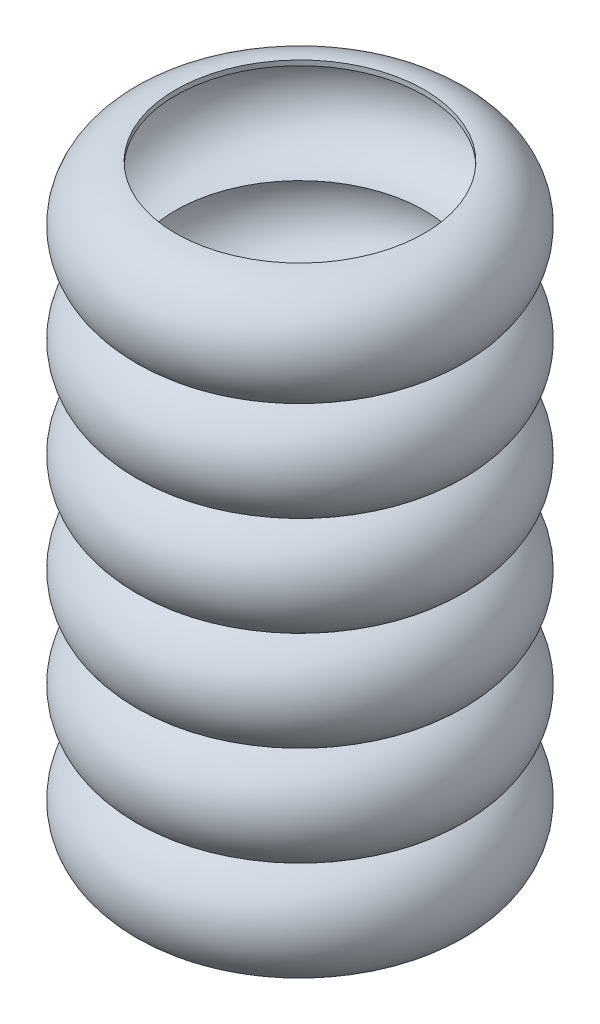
ISO-10303-21;
HEADER;
FILE_DESCRIPTION(('STEP AP214'),'2;1');
FILE_NAME('part.step','',(''),(''),'','','');
FILE_SCHEMA(('AUTOMOTIVE_DESIGN { 1 0 10303 214 1 1 1 1 }'));
ENDSEC;
DATA;
#1=APPLICATION_CONTEXT('core data for automotive mechanical design processes');
#2=APPLICATION_PROTOCOL_DEFINITION('international standard','automotive_design',2000,#1);
#3=PRODUCT_CONTEXT('',#1,'mechanical');
#4=PRODUCT('Part','Part','',(#3));
#5=PRODUCT_RELATED_PRODUCT_CATEGORY('part','',(#4));
#6=PRODUCT_DEFINITION_FORMATION('','',#4);
#7=PRODUCT_DEFINITION_CONTEXT('part definition',#1,'design');
#8=PRODUCT_DEFINITION('design','',#6,#7);
#9=PRODUCT_DEFINITION_SHAPE('','',#8);
#10=(LENGTH_UNIT() NAMED_UNIT(*) SI_UNIT(.MILLI.,.METRE.));
#11=(NAMED_UNIT(*) PLANE_ANGLE_UNIT() SI_UNIT($,.RADIAN.));
#12=(NAMED_UNIT(*) SI_UNIT($,.STERADIAN.) SOLID_ANGLE_UNIT());
#13=UNCERTAINTY_MEASURE_WITH_UNIT(LENGTH_MEASURE(1.E-05),#10,'distance_accuracy_value','');
#14=(GEOMETRIC_REPRESENTATION_CONTEXT(3) GLOBAL_UNCERTAINTY_ASSIGNED_CONTEXT((#13)) GLOBAL_UNIT_ASSIGNED_CONTEXT((#10,
#11,#12)) REPRESENTATION_CONTEXT('',''));
#15=CARTESIAN_POINT('',(0.,0.,0.));
#16=DIRECTION('',(0.,0.,1.));
#17=DIRECTION('',(1.,0.,0.));
#18=AXIS2_PLACEMENT_3D('',#15,#16,#17);
#19=CARTESIAN_POINT('',(0.,120.,0.));
#20=DIRECTION('',(0.,1.,0.));
#21=DIRECTION('',(0.,0.,1.));
#22=AXIS2_PLACEMENT_3D('',#19,#20,#21);
#23=CYLINDRICAL_SURFACE('',#22,25.);
#24=CARTESIAN_POINT('',(0.,120.,0.));
#25=DIRECTION('',(0.,-1.,0.));
#26=DIRECTION('',(0.,0.,-1.));
#27=AXIS2_PLACEMENT_3D('',#24,#25,#26);
#28=CIRCLE('',#27,25.);
#29=CARTESIAN_POINT('',(0.,120.,-25.));
#30=VERTEX_POINT('',#29);
#31=EDGE_CURVE('E83',#30,#30,#28,.F.);
#32=ORIENTED_EDGE('',*,*,#31,.F.);
#33=EDGE_LOOP('',(#32));
#34=FACE_BOUND('',#33,.T.);
#35=CARTESIAN_POINT('',(0.,121.,0.));
#36=DIRECTION('',(0.,-1.,0.));
#37=DIRECTION('',(0.,0.,-1.));
#38=AXIS2_PLACEMENT_3D('',#35,#36,#37);
#39=CIRCLE('',#38,25.);
#40=CARTESIAN_POINT('',(0.,121.,-25.));
#41=VERTEX_POINT('',#40);
#42=EDGE_CURVE('E10',#41,#41,#39,.F.);
#43=ORIENTED_EDGE('',*,*,#42,.T.);
#44=EDGE_LOOP('',(#43));
#45=FACE_BOUND('',#44,.T.);
#46=ADVANCED_FACE('F37',(#34,#45),#23,.F.);
#47=CARTESIAN_POINT('',(0.,30.,0.));
#48=DIRECTION('',(0.,-1.,0.));
#49=DIRECTION('',(0.,0.,-1.));
#50=AXIS2_PLACEMENT_3D('',#47,#48,#49);
#51=TOROIDAL_SURFACE('',#50,25.,11.);
#52=CARTESIAN_POINT('',(0.,40.,0.));
#53=DIRECTION('',(0.,1.,0.));
#54=DIRECTION('',(0.,0.,1.));
#55=AXIS2_PLACEMENT_3D('',#52,#53,#54);
#56=CIRCLE('',#55,29.5825756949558);
#57=CARTESIAN_POINT('',(0.,40.,29.5825756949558));
#58=VERTEX_POINT('',#57);
#59=EDGE_CURVE('E53',#58,#58,#56,.T.);
#60=ORIENTED_EDGE('',*,*,#59,.F.);
#61=EDGE_LOOP('',(#60));
#62=FACE_BOUND('',#61,.T.);
#63=CARTESIAN_POINT('',(0.,20.,0.));
#64=DIRECTION('',(0.,1.,0.));
#65=DIRECTION('',(0.,0.,1.));
#66=AXIS2_PLACEMENT_3D('',#63,#64,#65);
#67=CIRCLE('',#66,29.5825756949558);
#68=CARTESIAN_POINT('',(0.,20.,29.5825756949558));
#69=VERTEX_POINT('',#68);
#70=EDGE_CURVE('E48',#69,#69,#67,.T.);
#71=ORIENTED_EDGE('',*,*,#70,.T.);
#72=EDGE_LOOP('',(#71));
#73=FACE_BOUND('',#72,.T.);
#74=ADVANCED_FACE('F89',(#62,#73),#51,.T.);
#75=CARTESIAN_POINT('',(0.,-1.,0.));
#76=DIRECTION('',(0.,1.,0.));
#77=DIRECTION('',(0.,0.,1.));
#78=AXIS2_PLACEMENT_3D('',#75,#76,#77);
#79=PLANE('',#78);
#80=CARTESIAN_POINT('',(0.,-0.999999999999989,0.));
#81=DIRECTION('',(0.,-1.,0.));
#82=DIRECTION('',(0.,0.,-1.));
#83=AXIS2_PLACEMENT_3D('',#80,#81,#82);
#84=CIRCLE('',#83,25.);
#85=CARTESIAN_POINT('',(0.,-0.999999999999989,-25.));
#86=VERTEX_POINT('',#85);
#87=EDGE_CURVE('E44',#86,#86,#84,.F.);
#88=ORIENTED_EDGE('',*,*,#87,.F.);
#89=EDGE_LOOP('',(#88));
#90=FACE_BOUND('',#89,.T.);
#91=ADVANCED_FACE('F92',(#90),#79,.F.);
#92=CARTESIAN_POINT('',(0.,10.,0.));
#93=DIRECTION('',(0.,-1.,0.));
#94=DIRECTION('',(0.,0.,-1.));
#95=AXIS2_PLACEMENT_3D('',#92,#93,#94);
#96=TOROIDAL_SURFACE('',#95,25.,11.);
#97=ORIENTED_EDGE('',*,*,#70,.F.);
#98=EDGE_LOOP('',(#97));
#99=FACE_BOUND('',#98,.T.);
#100=ORIENTED_EDGE('',*,*,#87,.T.);
#101=EDGE_LOOP('',(#100));
#102=FACE_BOUND('',#101,.T.);
#103=ADVANCED_FACE('F96',(#99,#102),#96,.T.);
#104=CARTESIAN_POINT('',(0.,50.,0.));
#105=DIRECTION('',(0.,-1.,0.));
#106=DIRECTION('',(0.,0.,-1.));
#107=AXIS2_PLACEMENT_3D('',#104,#105,#106);
#108=TOROIDAL_SURFACE('',#107,25.,11.);
#109=CARTESIAN_POINT('',(0.,60.,0.));
#110=DIRECTION('',(0.,1.,0.));
#111=DIRECTION('',(0.,0.,1.));
#112=AXIS2_PLACEMENT_3D('',#109,#110,#111);
#113=CIRCLE('',#112,29.5825756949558);
#114=CARTESIAN_POINT('',(0.,60.,29.5825756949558));
#115=VERTEX_POINT('',#114);
#116=EDGE_CURVE('E57',#115,#115,#113,.T.);
#117=ORIENTED_EDGE('',*,*,#116,.F.);
#118=EDGE_LOOP('',(#117));
#119=FACE_BOUND('',#118,.T.);
#120=ORIENTED_EDGE('',*,*,#59,.T.);
#121=EDGE_LOOP('',(#120));
#122=FACE_BOUND('',#121,.T.);
#123=ADVANCED_FACE('F87',(#119,#122),#108,.T.);
#124=CARTESIAN_POINT('',(0.,70.,0.));
#125=DIRECTION('',(0.,-1.,0.));
#126=DIRECTION('',(0.,0.,-1.));
#127=AXIS2_PLACEMENT_3D('',#124,#125,#126);
#128=TOROIDAL_SURFACE('',#127,25.,11.);
#129=ORIENTED_EDGE('',*,*,#116,.T.);
#130=EDGE_LOOP('',(#129));
#131=FACE_BOUND('',#130,.T.);
#132=CARTESIAN_POINT('',(0.,80.,0.));
#133=DIRECTION('',(0.,1.,0.));
#134=DIRECTION('',(0.,0.,1.));
#135=AXIS2_PLACEMENT_3D('',#132,#133,#134);
#136=CIRCLE('',#135,29.5825756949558);
#137=CARTESIAN_POINT('',(0.,80.,29.5825756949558));
#138=VERTEX_POINT('',#137);
#139=EDGE_CURVE('E60',#138,#138,#136,.T.);
#140=ORIENTED_EDGE('',*,*,#139,.F.);
#141=EDGE_LOOP('',(#140));
#142=FACE_BOUND('',#141,.T.);
#143=ADVANCED_FACE('F103',(#131,#142),#128,.T.);
#144=CARTESIAN_POINT('',(0.,90.,0.));
#145=DIRECTION('',(0.,-1.,0.));
#146=DIRECTION('',(0.,0.,-1.));
#147=AXIS2_PLACEMENT_3D('',#144,#145,#146);
#148=TOROIDAL_SURFACE('',#147,25.,11.);
#149=ORIENTED_EDGE('',*,*,#139,.T.);
#150=EDGE_LOOP('',(#149));
#151=FACE_BOUND('',#150,.T.);
#152=CARTESIAN_POINT('',(0.,100.,0.));
#153=DIRECTION('',(0.,1.,0.));
#154=DIRECTION('',(0.,0.,1.));
#155=AXIS2_PLACEMENT_3D('',#152,#153,#154);
#156=CIRCLE('',#155,29.5825756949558);
#157=CARTESIAN_POINT('',(0.,100.,29.5825756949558));
#158=VERTEX_POINT('',#157);
#159=EDGE_CURVE('E62',#158,#158,#156,.T.);
#160=ORIENTED_EDGE('',*,*,#159,.F.);
#161=EDGE_LOOP('',(#160));
#162=FACE_BOUND('',#161,.T.);
#163=ADVANCED_FACE('F189',(#151,#162),#148,.T.);
#164=CARTESIAN_POINT('',(0.,110.,0.));
#165=DIRECTION('',(0.,-1.,0.));
#166=DIRECTION('',(0.,0.,-1.));
#167=AXIS2_PLACEMENT_3D('',#164,#165,#166);
#168=TOROIDAL_SURFACE('',#167,25.,11.);
#169=ORIENTED_EDGE('',*,*,#159,.T.);
#170=EDGE_LOOP('',(#169));
#171=FACE_BOUND('',#170,.T.);
#172=ORIENTED_EDGE('',*,*,#42,.F.);
#173=EDGE_LOOP('',(#172));
#174=FACE_BOUND('',#173,.T.);
#175=ADVANCED_FACE('F39',(#171,#174),#168,.T.);
#176=CARTESIAN_POINT('',(0.,30.,0.));
#177=DIRECTION('',(0.,-1.,0.));
#178=DIRECTION('',(0.,0.,-1.));
#179=AXIS2_PLACEMENT_3D('',#176,#177,#178);
#180=TOROIDAL_SURFACE('',#179,25.,9.99999999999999);
#181=CARTESIAN_POINT('',(0.,40.,0.));
#182=DIRECTION('',(0.,-1.,0.));
#183=DIRECTION('',(0.,0.,-1.));
#184=AXIS2_PLACEMENT_3D('',#181,#182,#183);
#185=CIRCLE('',#184,25.);
#186=CARTESIAN_POINT('',(0.,40.,-25.));
#187=VERTEX_POINT('',#186);
#188=EDGE_CURVE('E73',#187,#187,#185,.F.);
#189=ORIENTED_EDGE('',*,*,#188,.T.);
#190=EDGE_LOOP('',(#189));
#191=FACE_BOUND('',#190,.T.);
#192=CARTESIAN_POINT('',(0.,20.,0.));
#193=DIRECTION('',(0.,-1.,0.));
#194=DIRECTION('',(0.,0.,-1.));
#195=AXIS2_PLACEMENT_3D('',#192,#193,#194);
#196=CIRCLE('',#195,25.);
#197=CARTESIAN_POINT('',(0.,20.,-25.));
#198=VERTEX_POINT('',#197);
#199=EDGE_CURVE('E68',#198,#198,#196,.F.);
#200=ORIENTED_EDGE('',*,*,#199,.F.);
#201=EDGE_LOOP('',(#200));
#202=FACE_BOUND('',#201,.T.);
#203=ADVANCED_FACE('F119',(#191,#202),#180,.F.);
#204=CARTESIAN_POINT('',(0.,0.,0.));
#205=DIRECTION('',(0.,1.,0.));
#206=DIRECTION('',(0.,0.,1.));
#207=AXIS2_PLACEMENT_3D('',#204,#205,#206);
#208=PLANE('',#207);
#209=CARTESIAN_POINT('',(0.,0.,0.));
#210=DIRECTION('',(0.,1.,0.));
#211=DIRECTION('',(0.,0.,1.));
#212=AXIS2_PLACEMENT_3D('',#209,#210,#211);
#213=CIRCLE('',#212,25.);
#214=CARTESIAN_POINT('',(0.,0.,25.));
#215=VERTEX_POINT('',#214);
#216=EDGE_CURVE('E64',#215,#215,#213,.T.);
#217=ORIENTED_EDGE('',*,*,#216,.T.);
#218=EDGE_LOOP('',(#217));
#219=FACE_BOUND('',#218,.T.);
#220=ADVANCED_FACE('F115',(#219),#208,.T.);
#221=CARTESIAN_POINT('',(0.,10.,0.));
#222=DIRECTION('',(0.,-1.,0.));
#223=DIRECTION('',(0.,0.,-1.));
#224=AXIS2_PLACEMENT_3D('',#221,#222,#223);
#225=TOROIDAL_SURFACE('',#224,25.,9.99999999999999);
#226=ORIENTED_EDGE('',*,*,#199,.T.);
#227=EDGE_LOOP('',(#226));
#228=FACE_BOUND('',#227,.T.);
#229=ORIENTED_EDGE('',*,*,#216,.F.);
#230=EDGE_LOOP('',(#229));
#231=FACE_BOUND('',#230,.T.);
#232=ADVANCED_FACE('F118',(#228,#231),#225,.F.);
#233=CARTESIAN_POINT('',(0.,50.,0.));
#234=DIRECTION('',(0.,-1.,0.));
#235=DIRECTION('',(0.,0.,-1.));
#236=AXIS2_PLACEMENT_3D('',#233,#234,#235);
#237=TOROIDAL_SURFACE('',#236,25.,9.99999999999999);
#238=CARTESIAN_POINT('',(0.,60.,0.));
#239=DIRECTION('',(0.,-1.,0.));
#240=DIRECTION('',(0.,0.,-1.));
#241=AXIS2_PLACEMENT_3D('',#238,#239,#240);
#242=CIRCLE('',#241,25.);
#243=CARTESIAN_POINT('',(0.,60.,-25.));
#244=VERTEX_POINT('',#243);
#245=EDGE_CURVE('E80',#244,#244,#242,.F.);
#246=ORIENTED_EDGE('',*,*,#245,.T.);
#247=EDGE_LOOP('',(#246));
#248=FACE_BOUND('',#247,.T.);
#249=ORIENTED_EDGE('',*,*,#188,.F.);
#250=EDGE_LOOP('',(#249));
#251=FACE_BOUND('',#250,.T.);
#252=ADVANCED_FACE('F122',(#248,#251),#237,.F.);
#253=CARTESIAN_POINT('',(0.,70.,0.));
#254=DIRECTION('',(0.,-1.,0.));
#255=DIRECTION('',(0.,0.,-1.));
#256=AXIS2_PLACEMENT_3D('',#253,#254,#255);
#257=TOROIDAL_SURFACE('',#256,25.,9.99999999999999);
#258=ORIENTED_EDGE('',*,*,#245,.F.);
#259=EDGE_LOOP('',(#258));
#260=FACE_BOUND('',#259,.T.);
#261=CARTESIAN_POINT('',(0.,80.,0.));
#262=DIRECTION('',(0.,-1.,0.));
#263=DIRECTION('',(0.,0.,-1.));
#264=AXIS2_PLACEMENT_3D('',#261,#262,#263);
#265=CIRCLE('',#264,25.);
#266=CARTESIAN_POINT('',(0.,80.,-25.));
#267=VERTEX_POINT('',#266);
#268=EDGE_CURVE('E77',#267,#267,#265,.F.);
#269=ORIENTED_EDGE('',*,*,#268,.T.);
#270=EDGE_LOOP('',(#269));
#271=FACE_BOUND('',#270,.T.);
#272=ADVANCED_FACE('F129',(#260,#271),#257,.F.);
#273=CARTESIAN_POINT('',(0.,90.,0.));
#274=DIRECTION('',(0.,-1.,0.));
#275=DIRECTION('',(0.,0.,-1.));
#276=AXIS2_PLACEMENT_3D('',#273,#274,#275);
#277=TOROIDAL_SURFACE('',#276,25.,9.99999999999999);
#278=ORIENTED_EDGE('',*,*,#268,.F.);
#279=EDGE_LOOP('',(#278));
#280=FACE_BOUND('',#279,.T.);
#281=CARTESIAN_POINT('',(0.,100.,0.));
#282=DIRECTION('',(0.,-1.,0.));
#283=DIRECTION('',(0.,0.,-1.));
#284=AXIS2_PLACEMENT_3D('',#281,#282,#283);
#285=CIRCLE('',#284,25.);
#286=CARTESIAN_POINT('',(0.,100.,-25.));
#287=VERTEX_POINT('',#286);
#288=EDGE_CURVE('E81',#287,#287,#285,.F.);
#289=ORIENTED_EDGE('',*,*,#288,.T.);
#290=EDGE_LOOP('',(#289));
#291=FACE_BOUND('',#290,.T.);
#292=ADVANCED_FACE('F133',(#280,#291),#277,.F.);
#293=CARTESIAN_POINT('',(0.,110.,0.));
#294=DIRECTION('',(0.,-1.,0.));
#295=DIRECTION('',(0.,0.,-1.));
#296=AXIS2_PLACEMENT_3D('',#293,#294,#295);
#297=TOROIDAL_SURFACE('',#296,25.,9.99999999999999);
#298=ORIENTED_EDGE('',*,*,#288,.F.);
#299=EDGE_LOOP('',(#298));
#300=FACE_BOUND('',#299,.T.);
#301=ORIENTED_EDGE('',*,*,#31,.T.);
#302=EDGE_LOOP('',(#301));
#303=FACE_BOUND('',#302,.T.);
#304=ADVANCED_FACE('F137',(#300,#303),#297,.F.);
#305=CLOSED_SHELL('',(#46,#74,#91,#103,#123,#143,#163,#175,#203,#220,#232,#252,#272,#292,#304));
#306=MANIFOLD_SOLID_BREP('B2',#305);
#307=ADVANCED_BREP_SHAPE_REPRESENTATION('',(#18,#306),#14);
#308=SHAPE_DEFINITION_REPRESENTATION(#9,#307);
ENDSEC;
END-ISO-10303-21;
